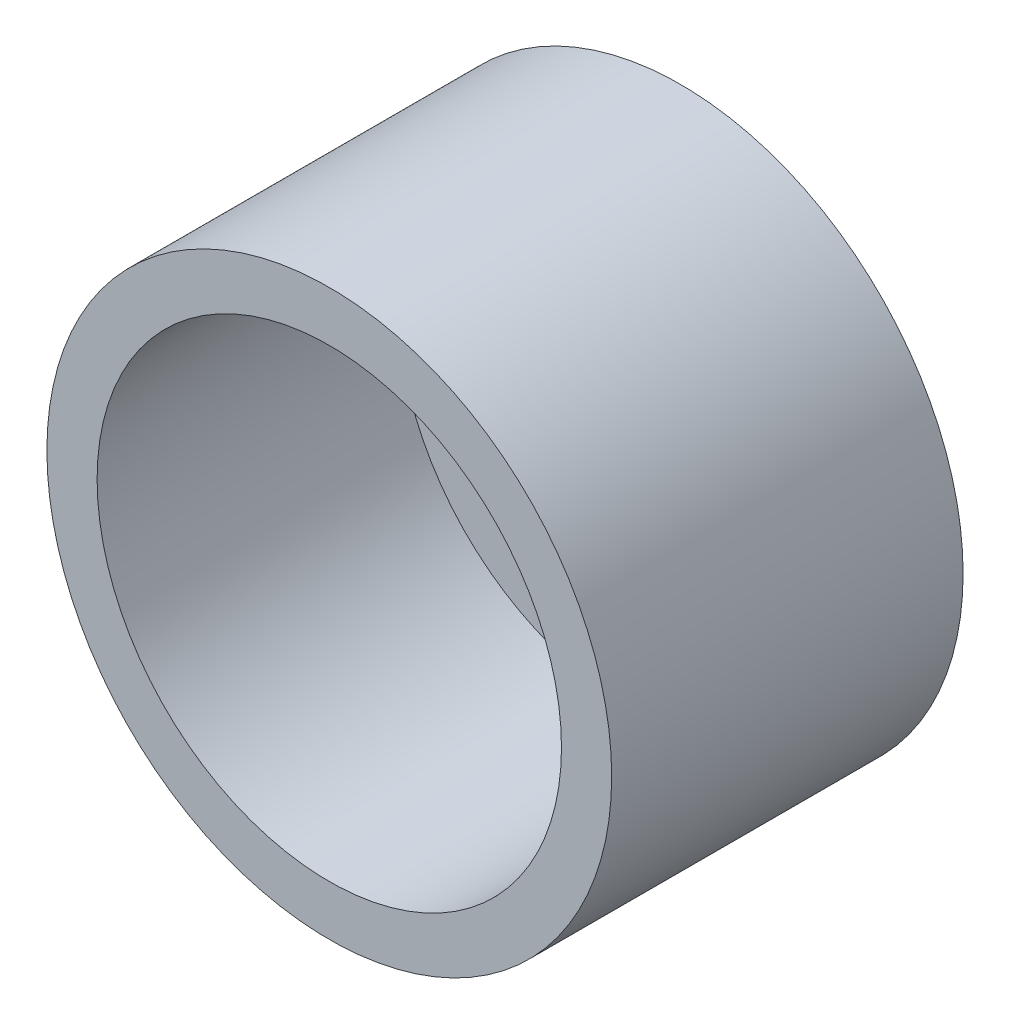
ISO-10303-21;
HEADER;
FILE_DESCRIPTION(('STEP AP214'),'2;1');
FILE_NAME('part.step','',(''),(''),'','','');
FILE_SCHEMA(('AUTOMOTIVE_DESIGN { 1 0 10303 214 1 1 1 1 }'));
ENDSEC;
DATA;
#1=APPLICATION_CONTEXT('core data for automotive mechanical design processes');
#2=APPLICATION_PROTOCOL_DEFINITION('international standard','automotive_design',2000,#1);
#3=PRODUCT_CONTEXT('',#1,'mechanical');
#4=PRODUCT('Part','Part','',(#3));
#5=PRODUCT_RELATED_PRODUCT_CATEGORY('part','',(#4));
#6=PRODUCT_DEFINITION_FORMATION('','',#4);
#7=PRODUCT_DEFINITION_CONTEXT('part definition',#1,'design');
#8=PRODUCT_DEFINITION('design','',#6,#7);
#9=PRODUCT_DEFINITION_SHAPE('','',#8);
#10=(LENGTH_UNIT() NAMED_UNIT(*) SI_UNIT(.MILLI.,.METRE.));
#11=(NAMED_UNIT(*) PLANE_ANGLE_UNIT() SI_UNIT($,.RADIAN.));
#12=(NAMED_UNIT(*) SI_UNIT($,.STERADIAN.) SOLID_ANGLE_UNIT());
#13=UNCERTAINTY_MEASURE_WITH_UNIT(LENGTH_MEASURE(1.E-05),#10,'distance_accuracy_value','');
#14=(GEOMETRIC_REPRESENTATION_CONTEXT(3) GLOBAL_UNCERTAINTY_ASSIGNED_CONTEXT((#13)) GLOBAL_UNIT_ASSIGNED_CONTEXT((#10,
#11,#12)) REPRESENTATION_CONTEXT('',''));
#15=CARTESIAN_POINT('',(0.,0.,0.));
#16=DIRECTION('',(0.,0.,1.));
#17=DIRECTION('',(1.,0.,0.));
#18=AXIS2_PLACEMENT_3D('',#15,#16,#17);
#19=CARTESIAN_POINT('',(0.,0.,17.78));
#20=DIRECTION('',(0.,0.,-1.));
#21=DIRECTION('',(-1.,0.,0.));
#22=AXIS2_PLACEMENT_3D('',#19,#20,#21);
#23=CYLINDRICAL_SURFACE('',#22,14.2875);
#24=CARTESIAN_POINT('',(0.,0.,17.78));
#25=DIRECTION('',(0.,0.,1.));
#26=DIRECTION('',(1.,0.,0.));
#27=AXIS2_PLACEMENT_3D('',#24,#25,#26);
#28=CIRCLE('',#27,14.2875);
#29=CARTESIAN_POINT('',(-14.2875,0.,17.78));
#30=VERTEX_POINT('',#29);
#31=EDGE_CURVE('E10',#30,#30,#28,.T.);
#32=CARTESIAN_POINT('',(0.,0.,0.));
#33=DIRECTION('',(0.,0.,1.));
#34=DIRECTION('',(1.,0.,0.));
#35=AXIS2_PLACEMENT_3D('',#32,#33,#34);
#36=CIRCLE('',#35,14.2875);
#37=CARTESIAN_POINT('',(-14.2875,0.,0.));
#38=VERTEX_POINT('',#37);
#39=EDGE_CURVE('E33',#38,#38,#36,.T.);
#40=CARTESIAN_POINT('',(-14.2875,0.,17.78));
#41=CARTESIAN_POINT('',(-14.2875,0.,17.5947916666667));
#42=CARTESIAN_POINT('',(-14.2875,0.,17.4095833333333));
#43=CARTESIAN_POINT('',(-14.2875,0.,17.0391666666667));
#44=CARTESIAN_POINT('',(-14.2875,0.,16.8539583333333));
#45=CARTESIAN_POINT('',(-14.2875,0.,16.4835416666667));
#46=CARTESIAN_POINT('',(-14.2875,0.,16.2983333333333));
#47=CARTESIAN_POINT('',(-14.2875,0.,15.9279166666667));
#48=CARTESIAN_POINT('',(-14.2875,0.,15.7427083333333));
#49=CARTESIAN_POINT('',(-14.2875,0.,15.3722916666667));
#50=CARTESIAN_POINT('',(-14.2875,0.,15.1870833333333));
#51=CARTESIAN_POINT('',(-14.2875,0.,14.8166666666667));
#52=CARTESIAN_POINT('',(-14.2875,0.,14.6314583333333));
#53=CARTESIAN_POINT('',(-14.2875,0.,14.2610416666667));
#54=CARTESIAN_POINT('',(-14.2875,0.,14.0758333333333));
#55=CARTESIAN_POINT('',(-14.2875,0.,13.7054166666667));
#56=CARTESIAN_POINT('',(-14.2875,0.,13.5202083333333));
#57=CARTESIAN_POINT('',(-14.2875,0.,13.1497916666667));
#58=CARTESIAN_POINT('',(-14.2875,0.,12.9645833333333));
#59=CARTESIAN_POINT('',(-14.2875,0.,12.5941666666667));
#60=CARTESIAN_POINT('',(-14.2875,0.,12.4089583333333));
#61=CARTESIAN_POINT('',(-14.2875,0.,12.0385416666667));
#62=CARTESIAN_POINT('',(-14.2875,0.,11.8533333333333));
#63=CARTESIAN_POINT('',(-14.2875,0.,11.4829166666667));
#64=CARTESIAN_POINT('',(-14.2875,0.,11.2977083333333));
#65=CARTESIAN_POINT('',(-14.2875,0.,10.9272916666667));
#66=CARTESIAN_POINT('',(-14.2875,0.,10.7420833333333));
#67=CARTESIAN_POINT('',(-14.2875,0.,10.3716666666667));
#68=CARTESIAN_POINT('',(-14.2875,0.,10.1864583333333));
#69=CARTESIAN_POINT('',(-14.2875,0.,9.81604166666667));
#70=CARTESIAN_POINT('',(-14.2875,0.,9.63083333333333));
#71=CARTESIAN_POINT('',(-14.2875,0.,9.26041666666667));
#72=CARTESIAN_POINT('',(-14.2875,0.,9.07520833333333));
#73=CARTESIAN_POINT('',(-14.2875,0.,8.70479166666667));
#74=CARTESIAN_POINT('',(-14.2875,0.,8.51958333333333));
#75=CARTESIAN_POINT('',(-14.2875,0.,8.14916666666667));
#76=CARTESIAN_POINT('',(-14.2875,0.,7.96395833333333));
#77=CARTESIAN_POINT('',(-14.2875,0.,7.59354166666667));
#78=CARTESIAN_POINT('',(-14.2875,0.,7.40833333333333));
#79=CARTESIAN_POINT('',(-14.2875,0.,7.03791666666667));
#80=CARTESIAN_POINT('',(-14.2875,0.,6.85270833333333));
#81=CARTESIAN_POINT('',(-14.2875,0.,6.48229166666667));
#82=CARTESIAN_POINT('',(-14.2875,0.,6.29708333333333));
#83=CARTESIAN_POINT('',(-14.2875,0.,5.92666666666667));
#84=CARTESIAN_POINT('',(-14.2875,0.,5.74145833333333));
#85=CARTESIAN_POINT('',(-14.2875,0.,5.37104166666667));
#86=CARTESIAN_POINT('',(-14.2875,0.,5.18583333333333));
#87=CARTESIAN_POINT('',(-14.2875,0.,4.81541666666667));
#88=CARTESIAN_POINT('',(-14.2875,0.,4.63020833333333));
#89=CARTESIAN_POINT('',(-14.2875,0.,4.25979166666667));
#90=CARTESIAN_POINT('',(-14.2875,0.,4.07458333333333));
#91=CARTESIAN_POINT('',(-14.2875,0.,3.70416666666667));
#92=CARTESIAN_POINT('',(-14.2875,0.,3.51895833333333));
#93=CARTESIAN_POINT('',(-14.2875,0.,3.14854166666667));
#94=CARTESIAN_POINT('',(-14.2875,0.,2.96333333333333));
#95=CARTESIAN_POINT('',(-14.2875,0.,2.59291666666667));
#96=CARTESIAN_POINT('',(-14.2875,0.,2.40770833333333));
#97=CARTESIAN_POINT('',(-14.2875,0.,2.03729166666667));
#98=CARTESIAN_POINT('',(-14.2875,0.,1.85208333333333));
#99=CARTESIAN_POINT('',(-14.2875,0.,1.48166666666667));
#100=CARTESIAN_POINT('',(-14.2875,0.,1.29645833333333));
#101=CARTESIAN_POINT('',(-14.2875,0.,0.926041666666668));
#102=CARTESIAN_POINT('',(-14.2875,0.,0.740833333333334));
#103=CARTESIAN_POINT('',(-14.2875,0.,0.370416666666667));
#104=CARTESIAN_POINT('',(-14.2875,0.,0.185208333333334));
#105=CARTESIAN_POINT('',(-14.2875,0.,0.));
#106=B_SPLINE_CURVE_WITH_KNOTS('',3,(#40,#41,#42,#43,#44,#45,#46,#47,#48,#49,#50,#51,#52,#53,
#54,#55,#56,#57,#58,#59,#60,#61,#62,#63,#64,#65,#66,#67,#68,#69,#70,#71,#72,#73,#74,#75,#76,#77,
#78,#79,#80,#81,#82,#83,#84,#85,#86,#87,#88,#89,#90,#91,#92,#93,#94,#95,#96,#97,#98,#99,#100,
#101,#102,#103,#104,#105),.UNSPECIFIED.,.F.,.F.,(4,2,2,2,2,2,2,2,2,2,2,2,2,2,2,2,2,2,2,2,2,2,2,
2,2,2,2,2,2,2,2,2,4),(0.,0.555624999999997,1.11125,1.666875,2.2225,2.778125,3.33375,3.889375,
4.445,5.000625,5.55625,6.111875,6.6675,7.223125,7.77875,8.334375,8.89,9.445625,10.00125,
10.556875,11.1125,11.668125,12.22375,12.779375,13.335,13.890625,14.44625,15.001875,15.5575,
16.113125,16.66875,17.224375,17.78),.UNSPECIFIED.);
#107=EDGE_CURVE('BSEAM30',#30,#38,#106,.T.);
#108=ORIENTED_EDGE('',*,*,#31,.F.);
#109=ORIENTED_EDGE('',*,*,#39,.T.);
#110=ORIENTED_EDGE('',*,*,#107,.T.);
#111=ORIENTED_EDGE('',*,*,#107,.F.);
#112=EDGE_LOOP('',(#108,#110,#109,#111));
#113=FACE_BOUND('',#112,.T.);
#114=ADVANCED_FACE('F30',(#113),#23,.T.);
#115=CARTESIAN_POINT('',(0.,0.,17.78));
#116=DIRECTION('',(0.,0.,1.));
#117=DIRECTION('',(1.,0.,0.));
#118=AXIS2_PLACEMENT_3D('',#115,#116,#117);
#119=PLANE('',#118);
#120=CARTESIAN_POINT('',(0.,0.,17.78));
#121=DIRECTION('',(0.,0.,1.));
#122=DIRECTION('',(1.,0.,0.));
#123=AXIS2_PLACEMENT_3D('',#120,#121,#122);
#124=CIRCLE('',#123,11.7475);
#125=CARTESIAN_POINT('',(-11.7475,0.,17.78));
#126=VERTEX_POINT('',#125);
#127=EDGE_CURVE('E40',#126,#126,#124,.T.);
#128=ORIENTED_EDGE('',*,*,#127,.F.);
#129=EDGE_LOOP('',(#128));
#130=FACE_BOUND('',#129,.T.);
#131=ORIENTED_EDGE('',*,*,#31,.T.);
#132=EDGE_LOOP('',(#131));
#133=FACE_BOUND('',#132,.T.);
#134=ADVANCED_FACE('F60',(#130,#133),#119,.T.);
#135=CARTESIAN_POINT('',(0.,0.,0.));
#136=DIRECTION('',(0.,0.,1.));
#137=DIRECTION('',(1.,0.,0.));
#138=AXIS2_PLACEMENT_3D('',#135,#136,#137);
#139=PLANE('',#138);
#140=ORIENTED_EDGE('',*,*,#39,.F.);
#141=EDGE_LOOP('',(#140));
#142=FACE_BOUND('',#141,.T.);
#143=ADVANCED_FACE('F52',(#142),#139,.F.);
#144=CARTESIAN_POINT('',(0.,0.,17.78));
#145=DIRECTION('',(0.,0.,-1.));
#146=DIRECTION('',(-1.,0.,0.));
#147=AXIS2_PLACEMENT_3D('',#144,#145,#146);
#148=CYLINDRICAL_SURFACE('',#147,11.7475);
#149=CARTESIAN_POINT('',(0.,0.,2.54));
#150=DIRECTION('',(0.,0.,1.));
#151=DIRECTION('',(1.,0.,0.));
#152=AXIS2_PLACEMENT_3D('',#149,#150,#151);
#153=CIRCLE('',#152,11.7475);
#154=CARTESIAN_POINT('',(-11.7475,0.,2.54));
#155=VERTEX_POINT('',#154);
#156=EDGE_CURVE('E44',#155,#155,#153,.T.);
#157=CARTESIAN_POINT('',(-11.7475,0.,17.78));
#158=CARTESIAN_POINT('',(-11.7475,0.,17.62125));
#159=CARTESIAN_POINT('',(-11.7475,0.,17.4625));
#160=CARTESIAN_POINT('',(-11.7475,0.,17.145));
#161=CARTESIAN_POINT('',(-11.7475,0.,16.98625));
#162=CARTESIAN_POINT('',(-11.7475,0.,16.66875));
#163=CARTESIAN_POINT('',(-11.7475,0.,16.51));
#164=CARTESIAN_POINT('',(-11.7475,0.,16.1925));
#165=CARTESIAN_POINT('',(-11.7475,0.,16.03375));
#166=CARTESIAN_POINT('',(-11.7475,0.,15.71625));
#167=CARTESIAN_POINT('',(-11.7475,0.,15.5575));
#168=CARTESIAN_POINT('',(-11.7475,0.,15.24));
#169=CARTESIAN_POINT('',(-11.7475,0.,15.08125));
#170=CARTESIAN_POINT('',(-11.7475,0.,14.76375));
#171=CARTESIAN_POINT('',(-11.7475,0.,14.605));
#172=CARTESIAN_POINT('',(-11.7475,0.,14.2875));
#173=CARTESIAN_POINT('',(-11.7475,0.,14.12875));
#174=CARTESIAN_POINT('',(-11.7475,0.,13.81125));
#175=CARTESIAN_POINT('',(-11.7475,0.,13.6525));
#176=CARTESIAN_POINT('',(-11.7475,0.,13.335));
#177=CARTESIAN_POINT('',(-11.7475,0.,13.17625));
#178=CARTESIAN_POINT('',(-11.7475,0.,12.85875));
#179=CARTESIAN_POINT('',(-11.7475,0.,12.7));
#180=CARTESIAN_POINT('',(-11.7475,0.,12.3825));
#181=CARTESIAN_POINT('',(-11.7475,0.,12.22375));
#182=CARTESIAN_POINT('',(-11.7475,0.,11.90625));
#183=CARTESIAN_POINT('',(-11.7475,0.,11.7475));
#184=CARTESIAN_POINT('',(-11.7475,0.,11.43));
#185=CARTESIAN_POINT('',(-11.7475,0.,11.27125));
#186=CARTESIAN_POINT('',(-11.7475,0.,10.95375));
#187=CARTESIAN_POINT('',(-11.7475,0.,10.795));
#188=CARTESIAN_POINT('',(-11.7475,0.,10.4775));
#189=CARTESIAN_POINT('',(-11.7475,0.,10.31875));
#190=CARTESIAN_POINT('',(-11.7475,0.,10.00125));
#191=CARTESIAN_POINT('',(-11.7475,0.,9.8425));
#192=CARTESIAN_POINT('',(-11.7475,0.,9.525));
#193=CARTESIAN_POINT('',(-11.7475,0.,9.36625));
#194=CARTESIAN_POINT('',(-11.7475,0.,9.04875));
#195=CARTESIAN_POINT('',(-11.7475,0.,8.89));
#196=CARTESIAN_POINT('',(-11.7475,0.,8.5725));
#197=CARTESIAN_POINT('',(-11.7475,0.,8.41375));
#198=CARTESIAN_POINT('',(-11.7475,0.,8.09625));
#199=CARTESIAN_POINT('',(-11.7475,0.,7.9375));
#200=CARTESIAN_POINT('',(-11.7475,0.,7.62));
#201=CARTESIAN_POINT('',(-11.7475,0.,7.46125));
#202=CARTESIAN_POINT('',(-11.7475,0.,7.14375));
#203=CARTESIAN_POINT('',(-11.7475,0.,6.985));
#204=CARTESIAN_POINT('',(-11.7475,0.,6.6675));
#205=CARTESIAN_POINT('',(-11.7475,0.,6.50875));
#206=CARTESIAN_POINT('',(-11.7475,0.,6.19125));
#207=CARTESIAN_POINT('',(-11.7475,0.,6.0325));
#208=CARTESIAN_POINT('',(-11.7475,0.,5.715));
#209=CARTESIAN_POINT('',(-11.7475,0.,5.55625));
#210=CARTESIAN_POINT('',(-11.7475,0.,5.23875));
#211=CARTESIAN_POINT('',(-11.7475,0.,5.08));
#212=CARTESIAN_POINT('',(-11.7475,0.,4.7625));
#213=CARTESIAN_POINT('',(-11.7475,0.,4.60375));
#214=CARTESIAN_POINT('',(-11.7475,0.,4.28625));
#215=CARTESIAN_POINT('',(-11.7475,0.,4.1275));
#216=CARTESIAN_POINT('',(-11.7475,0.,3.81));
#217=CARTESIAN_POINT('',(-11.7475,0.,3.65125));
#218=CARTESIAN_POINT('',(-11.7475,0.,3.33375));
#219=CARTESIAN_POINT('',(-11.7475,0.,3.175));
#220=CARTESIAN_POINT('',(-11.7475,0.,2.8575));
#221=CARTESIAN_POINT('',(-11.7475,0.,2.69875));
#222=CARTESIAN_POINT('',(-11.7475,0.,2.54));
#223=B_SPLINE_CURVE_WITH_KNOTS('',3,(#157,#158,#159,#160,#161,#162,#163,#164,#165,#166,#167,
#168,#169,#170,#171,#172,#173,#174,#175,#176,#177,#178,#179,#180,#181,#182,#183,#184,#185,#186,
#187,#188,#189,#190,#191,#192,#193,#194,#195,#196,#197,#198,#199,#200,#201,#202,#203,#204,#205,
#206,#207,#208,#209,#210,#211,#212,#213,#214,#215,#216,#217,#218,#219,#220,#221,#222),
.UNSPECIFIED.,.F.,.F.,(4,2,2,2,2,2,2,2,2,2,2,2,2,2,2,2,2,2,2,2,2,2,2,2,2,2,2,2,2,2,2,2,4),(0.,
0.476250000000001,0.952500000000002,1.42875,1.905,2.38125,2.8575,3.33375,3.81,4.28625,4.7625,
5.23875,5.715,6.19125,6.6675,7.14375,7.62,8.09625,8.5725,9.04875,9.525,10.00125,10.4775,
10.95375,11.43,11.90625,12.3825,12.85875,13.335,13.81125,14.2875,14.76375,15.24),.UNSPECIFIED.);
#224=EDGE_CURVE('BSEAM50',#126,#155,#223,.T.);
#225=ORIENTED_EDGE('',*,*,#127,.T.);
#226=ORIENTED_EDGE('',*,*,#156,.F.);
#227=ORIENTED_EDGE('',*,*,#224,.T.);
#228=ORIENTED_EDGE('',*,*,#224,.F.);
#229=EDGE_LOOP('',(#225,#227,#226,#228));
#230=FACE_BOUND('',#229,.T.);
#231=ADVANCED_FACE('F50',(#230),#148,.F.);
#232=CARTESIAN_POINT('',(0.,0.,2.54));
#233=DIRECTION('',(0.,0.,1.));
#234=DIRECTION('',(1.,0.,0.));
#235=AXIS2_PLACEMENT_3D('',#232,#233,#234);
#236=PLANE('',#235);
#237=ORIENTED_EDGE('',*,*,#156,.T.);
#238=EDGE_LOOP('',(#237));
#239=FACE_BOUND('',#238,.T.);
#240=ADVANCED_FACE('F48',(#239),#236,.T.);
#241=CLOSED_SHELL('',(#114,#134,#143,#231,#240));
#242=MANIFOLD_SOLID_BREP('B2',#241);
#243=ADVANCED_BREP_SHAPE_REPRESENTATION('',(#18,#242),#14);
#244=SHAPE_DEFINITION_REPRESENTATION(#9,#243);
ENDSEC;
END-ISO-10303-21;
